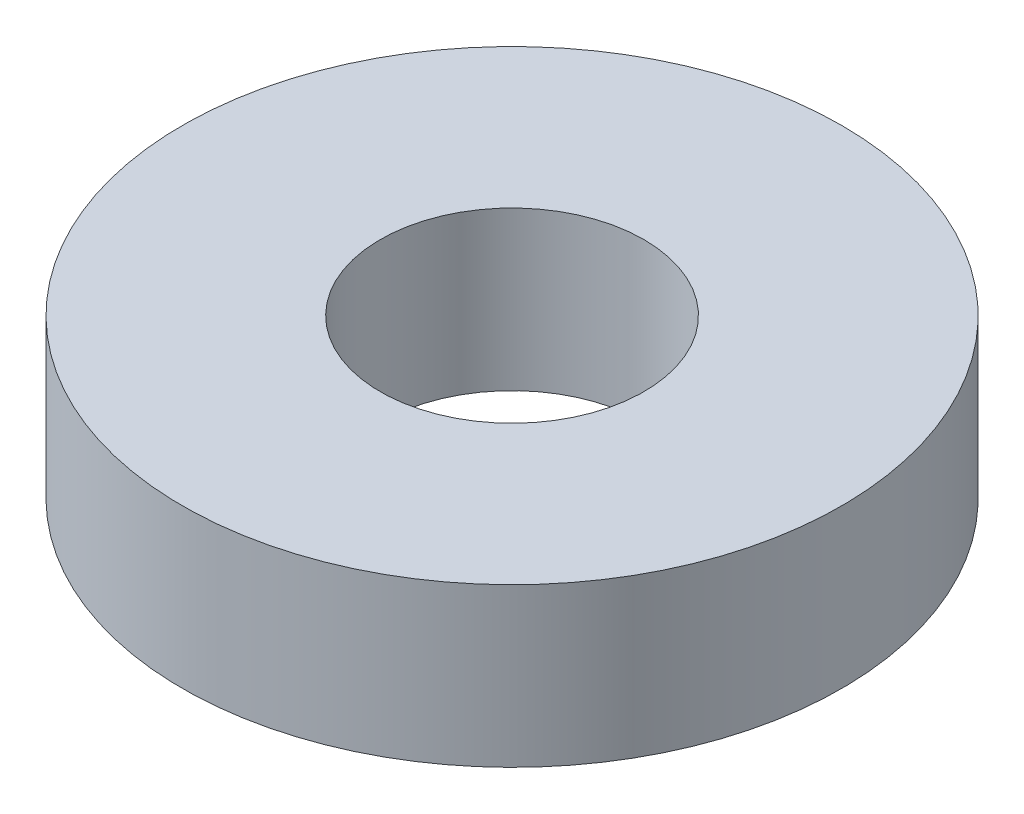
from build123d import *

# Parameters (mm, degrees)
SKETCH1_R           = 7.9375
SKETCH1_R_2         = 3.175
BOSS_EXTRUDE1_DEPTH = 1.905


with BuildPart() as part:
    # Sketch1 → Boss-Extrude1 (new, symmetric)
    with BuildSketch(Plane(origin=(0, 0, 0), x_dir=(1, 0, 0), z_dir=(0, 1, 0))):
        with Locations(Location((0, 0, 0), (0, 0, 90))):
            Circle(SKETCH1_R)
        with Locations(Location((0, 0, 0), (0, 0, 90))):
            Circle(SKETCH1_R_2, mode=Mode.SUBTRACT)
    extrude(amount=BOSS_EXTRUDE1_DEPTH, both=True)


solid = part.part
